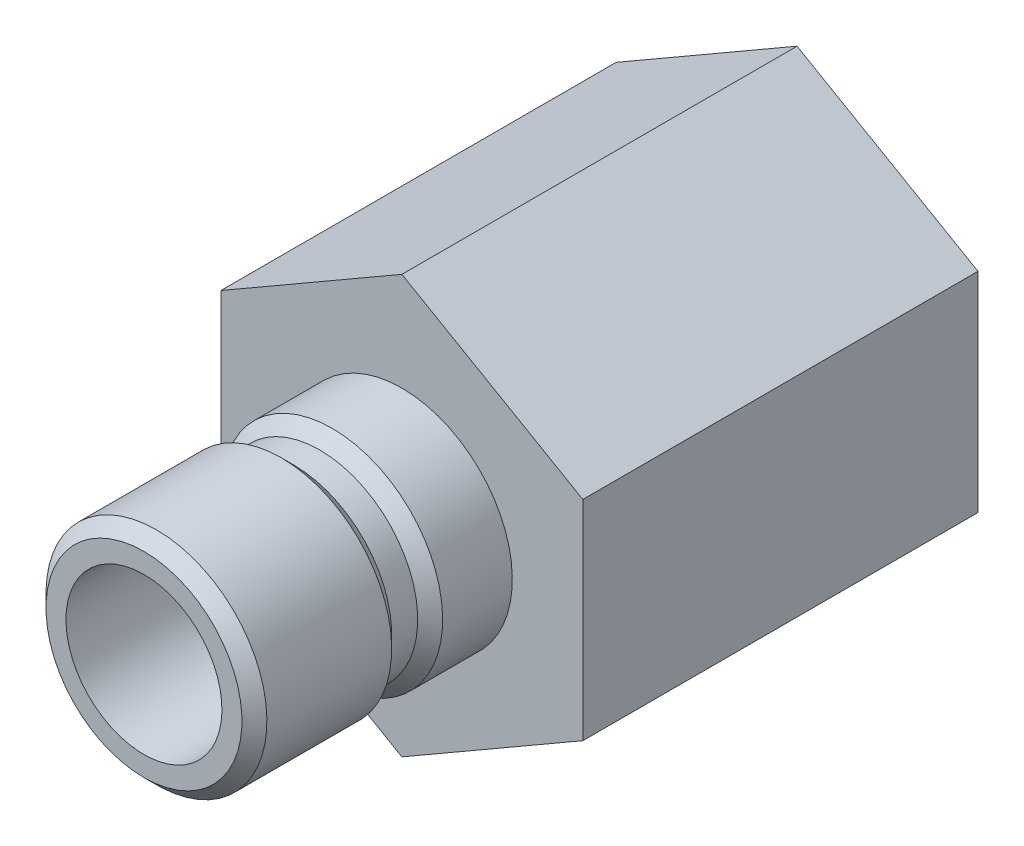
ISO-10303-21;
HEADER;
FILE_DESCRIPTION(('STEP AP214'),'2;1');
FILE_NAME('part.step','',(''),(''),'','','');
FILE_SCHEMA(('AUTOMOTIVE_DESIGN { 1 0 10303 214 1 1 1 1 }'));
ENDSEC;
DATA;
#1=APPLICATION_CONTEXT('core data for automotive mechanical design processes');
#2=APPLICATION_PROTOCOL_DEFINITION('international standard','automotive_design',2000,#1);
#3=PRODUCT_CONTEXT('',#1,'mechanical');
#4=PRODUCT('Part','Part','',(#3));
#5=PRODUCT_RELATED_PRODUCT_CATEGORY('part','',(#4));
#6=PRODUCT_DEFINITION_FORMATION('','',#4);
#7=PRODUCT_DEFINITION_CONTEXT('part definition',#1,'design');
#8=PRODUCT_DEFINITION('design','',#6,#7);
#9=PRODUCT_DEFINITION_SHAPE('','',#8);
#10=(LENGTH_UNIT() NAMED_UNIT(*) SI_UNIT(.MILLI.,.METRE.));
#11=(NAMED_UNIT(*) PLANE_ANGLE_UNIT() SI_UNIT($,.RADIAN.));
#12=(NAMED_UNIT(*) SI_UNIT($,.STERADIAN.) SOLID_ANGLE_UNIT());
#13=UNCERTAINTY_MEASURE_WITH_UNIT(LENGTH_MEASURE(1.E-05),#10,'distance_accuracy_value','');
#14=(GEOMETRIC_REPRESENTATION_CONTEXT(3) GLOBAL_UNCERTAINTY_ASSIGNED_CONTEXT((#13)) GLOBAL_UNIT_ASSIGNED_CONTEXT((#10,
#11,#12)) REPRESENTATION_CONTEXT('',''));
#15=CARTESIAN_POINT('',(0.,0.,0.));
#16=DIRECTION('',(0.,0.,1.));
#17=DIRECTION('',(1.,0.,0.));
#18=AXIS2_PLACEMENT_3D('',#15,#16,#17);
#19=CARTESIAN_POINT('',(0.,13.2842,-24.13));
#20=DIRECTION('',(0.,0.,-1.));
#21=DIRECTION('',(0.,1.,0.));
#22=AXIS2_PLACEMENT_3D('',#19,#20,#21);
#23=PLANE('',#22);
#24=CARTESIAN_POINT('',(0.,0.,-24.13));
#25=DIRECTION('',(0.,0.,-1.));
#26=DIRECTION('',(0.,1.,0.));
#27=AXIS2_PLACEMENT_3D('',#24,#25,#26);
#28=CIRCLE('',#27,9.40156906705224);
#29=CARTESIAN_POINT('',(0.,9.40156906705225,-24.13));
#30=VERTEX_POINT('',#29);
#31=EDGE_CURVE('E162',#30,#30,#28,.T.);
#32=ORIENTED_EDGE('',*,*,#31,.F.);
#33=EDGE_LOOP('',(#32));
#34=FACE_BOUND('',#33,.T.);
#35=DIRECTION('',(0.,-1.,0.));
#36=VECTOR('',#35,1.);
#37=CARTESIAN_POINT('',(-11.049,6.37914312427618,-24.13));
#38=LINE('',#37,#36);
#39=CARTESIAN_POINT('',(-11.049,6.37914312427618,-24.13));
#40=VERTEX_POINT('',#39);
#41=CARTESIAN_POINT('',(-11.049,-6.37914312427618,-24.13));
#42=VERTEX_POINT('',#41);
#43=EDGE_CURVE('E104',#40,#42,#38,.T.);
#44=ORIENTED_EDGE('',*,*,#43,.F.);
#45=DIRECTION('',(-0.866025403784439,-0.5,0.));
#46=VECTOR('',#45,1.);
#47=CARTESIAN_POINT('',(0.,12.7582862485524,-24.13));
#48=LINE('',#47,#46);
#49=CARTESIAN_POINT('',(0.,12.7582862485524,-24.13));
#50=VERTEX_POINT('',#49);
#51=EDGE_CURVE('E49',#50,#40,#48,.T.);
#52=ORIENTED_EDGE('',*,*,#51,.F.);
#53=DIRECTION('',(-0.866025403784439,0.5,0.));
#54=VECTOR('',#53,1.);
#55=CARTESIAN_POINT('',(11.049,6.37914312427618,-24.13));
#56=LINE('',#55,#54);
#57=CARTESIAN_POINT('',(11.049,6.37914312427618,-24.13));
#58=VERTEX_POINT('',#57);
#59=EDGE_CURVE('E110',#58,#50,#56,.T.);
#60=ORIENTED_EDGE('',*,*,#59,.F.);
#61=DIRECTION('',(0.,1.,0.));
#62=VECTOR('',#61,1.);
#63=CARTESIAN_POINT('',(11.049,-6.37914312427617,-24.13));
#64=LINE('',#63,#62);
#65=CARTESIAN_POINT('',(11.049,-6.37914312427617,-24.13));
#66=VERTEX_POINT('',#65);
#67=EDGE_CURVE('E108',#66,#58,#64,.T.);
#68=ORIENTED_EDGE('',*,*,#67,.F.);
#69=DIRECTION('',(0.866025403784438,0.5,0.));
#70=VECTOR('',#69,1.);
#71=CARTESIAN_POINT('',(0.,-12.7582862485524,-24.13));
#72=LINE('',#71,#70);
#73=CARTESIAN_POINT('',(0.,-12.7582862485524,-24.13));
#74=VERTEX_POINT('',#73);
#75=EDGE_CURVE('E91',#74,#66,#72,.T.);
#76=ORIENTED_EDGE('',*,*,#75,.F.);
#77=DIRECTION('',(0.866025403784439,-0.5,0.));
#78=VECTOR('',#77,1.);
#79=CARTESIAN_POINT('',(-11.049,-6.37914312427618,-24.13));
#80=LINE('',#79,#78);
#81=EDGE_CURVE('E99',#42,#74,#80,.T.);
#82=ORIENTED_EDGE('',*,*,#81,.F.);
#83=EDGE_LOOP('',(#44,#52,#60,#68,#76,#82));
#84=FACE_BOUND('',#83,.T.);
#85=ADVANCED_FACE('F34',(#34,#84),#23,.T.);
#86=CARTESIAN_POINT('',(0.,6.7437,0.));
#87=DIRECTION('',(0.,0.,1.));
#88=DIRECTION('',(0.,-1.,0.));
#89=AXIS2_PLACEMENT_3D('',#86,#87,#88);
#90=PLANE('',#89);
#91=CARTESIAN_POINT('',(0.,0.,0.));
#92=DIRECTION('',(0.,0.,-1.));
#93=DIRECTION('',(0.,1.,0.));
#94=AXIS2_PLACEMENT_3D('',#91,#92,#93);
#95=CIRCLE('',#94,6.7437);
#96=CARTESIAN_POINT('',(0.,6.7437,0.));
#97=VERTEX_POINT('',#96);
#98=EDGE_CURVE('E159',#97,#97,#95,.T.);
#99=ORIENTED_EDGE('',*,*,#98,.T.);
#100=EDGE_LOOP('',(#99));
#101=FACE_BOUND('',#100,.T.);
#102=DIRECTION('',(-0.866025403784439,0.5,0.));
#103=VECTOR('',#102,1.);
#104=CARTESIAN_POINT('',(11.049,6.37914312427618,0.));
#105=LINE('',#104,#103);
#106=CARTESIAN_POINT('',(11.049,6.37914312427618,0.));
#107=VERTEX_POINT('',#106);
#108=CARTESIAN_POINT('',(0.,12.7582862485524,0.));
#109=VERTEX_POINT('',#108);
#110=EDGE_CURVE('E128',#107,#109,#105,.T.);
#111=ORIENTED_EDGE('',*,*,#110,.T.);
#112=DIRECTION('',(-0.866025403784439,-0.5,0.));
#113=VECTOR('',#112,1.);
#114=CARTESIAN_POINT('',(0.,12.7582862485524,0.));
#115=LINE('',#114,#113);
#116=CARTESIAN_POINT('',(-11.049,6.37914312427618,0.));
#117=VERTEX_POINT('',#116);
#118=EDGE_CURVE('E117',#109,#117,#115,.T.);
#119=ORIENTED_EDGE('',*,*,#118,.T.);
#120=DIRECTION('',(0.,-1.,0.));
#121=VECTOR('',#120,1.);
#122=CARTESIAN_POINT('',(-11.049,6.37914312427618,0.));
#123=LINE('',#122,#121);
#124=CARTESIAN_POINT('',(-11.049,-6.37914312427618,0.));
#125=VERTEX_POINT('',#124);
#126=EDGE_CURVE('E120',#117,#125,#123,.T.);
#127=ORIENTED_EDGE('',*,*,#126,.T.);
#128=DIRECTION('',(0.866025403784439,-0.5,0.));
#129=VECTOR('',#128,1.);
#130=CARTESIAN_POINT('',(-11.049,-6.37914312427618,0.));
#131=LINE('',#130,#129);
#132=CARTESIAN_POINT('',(0.,-12.7582862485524,0.));
#133=VERTEX_POINT('',#132);
#134=EDGE_CURVE('E57',#125,#133,#131,.T.);
#135=ORIENTED_EDGE('',*,*,#134,.T.);
#136=DIRECTION('',(0.866025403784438,0.5,0.));
#137=VECTOR('',#136,1.);
#138=CARTESIAN_POINT('',(0.,-12.7582862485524,0.));
#139=LINE('',#138,#137);
#140=CARTESIAN_POINT('',(11.049,-6.37914312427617,0.));
#141=VERTEX_POINT('',#140);
#142=EDGE_CURVE('E94',#133,#141,#139,.T.);
#143=ORIENTED_EDGE('',*,*,#142,.T.);
#144=DIRECTION('',(0.,1.,0.));
#145=VECTOR('',#144,1.);
#146=CARTESIAN_POINT('',(11.049,-6.37914312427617,0.));
#147=LINE('',#146,#145);
#148=EDGE_CURVE('E125',#141,#107,#147,.T.);
#149=ORIENTED_EDGE('',*,*,#148,.T.);
#150=EDGE_LOOP('',(#111,#119,#127,#135,#143,#149));
#151=FACE_BOUND('',#150,.T.);
#152=ADVANCED_FACE('F184',(#101,#151),#90,.T.);
#153=CARTESIAN_POINT('',(0.,0.,0.));
#154=DIRECTION('',(0.,0.,-1.));
#155=DIRECTION('',(0.,1.,0.));
#156=AXIS2_PLACEMENT_3D('',#153,#154,#155);
#157=CYLINDRICAL_SURFACE('',#156,4.7625);
#158=CARTESIAN_POINT('',(0.,0.,-8.97890000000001));
#159=DIRECTION('',(0.,0.,-1.));
#160=DIRECTION('',(0.,1.,0.));
#161=AXIS2_PLACEMENT_3D('',#158,#159,#160);
#162=CIRCLE('',#161,4.7625);
#163=CARTESIAN_POINT('',(0.,4.7625,-8.97890000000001));
#164=VERTEX_POINT('',#163);
#165=EDGE_CURVE('E12',#164,#164,#162,.T.);
#166=ORIENTED_EDGE('',*,*,#165,.T.);
#167=EDGE_LOOP('',(#166));
#168=FACE_BOUND('',#167,.T.);
#169=CARTESIAN_POINT('',(0.,0.,15.748));
#170=DIRECTION('',(0.,0.,-1.));
#171=DIRECTION('',(0.,1.,0.));
#172=AXIS2_PLACEMENT_3D('',#169,#170,#171);
#173=CIRCLE('',#172,4.7625);
#174=CARTESIAN_POINT('',(0.,4.7625,15.748));
#175=VERTEX_POINT('',#174);
#176=EDGE_CURVE('E133',#175,#175,#173,.T.);
#177=ORIENTED_EDGE('',*,*,#176,.F.);
#178=EDGE_LOOP('',(#177));
#179=FACE_BOUND('',#178,.T.);
#180=ADVANCED_FACE('F36',(#168,#179),#157,.F.);
#181=CARTESIAN_POINT('',(0.,4.7625,-8.97890000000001));
#182=DIRECTION('',(0.,0.,-1.));
#183=DIRECTION('',(0.,1.,0.));
#184=AXIS2_PLACEMENT_3D('',#181,#182,#183);
#185=PLANE('',#184);
#186=CARTESIAN_POINT('',(0.,0.,-8.97890000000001));
#187=DIRECTION('',(0.,0.,-1.));
#188=DIRECTION('',(0.,1.,0.));
#189=AXIS2_PLACEMENT_3D('',#186,#187,#188);
#190=CIRCLE('',#189,8.9281);
#191=CARTESIAN_POINT('',(0.,8.9281,-8.97890000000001));
#192=VERTEX_POINT('',#191);
#193=EDGE_CURVE('E42',#192,#192,#190,.T.);
#194=ORIENTED_EDGE('',*,*,#193,.T.);
#195=EDGE_LOOP('',(#194));
#196=FACE_BOUND('',#195,.T.);
#197=ORIENTED_EDGE('',*,*,#165,.F.);
#198=EDGE_LOOP('',(#197));
#199=FACE_BOUND('',#198,.T.);
#200=ADVANCED_FACE('F167',(#196,#199),#185,.T.);
#201=CARTESIAN_POINT('',(0.,0.,-8.97890000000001));
#202=DIRECTION('',(0.,0.,-1.));
#203=DIRECTION('',(0.,1.,0.));
#204=AXIS2_PLACEMENT_3D('',#201,#202,#203);
#205=CONICAL_SURFACE('',#204,8.9281,0.0312396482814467);
#206=ORIENTED_EDGE('',*,*,#31,.T.);
#207=EDGE_LOOP('',(#206));
#208=FACE_BOUND('',#207,.T.);
#209=ORIENTED_EDGE('',*,*,#193,.F.);
#210=EDGE_LOOP('',(#209));
#211=FACE_BOUND('',#210,.T.);
#212=ADVANCED_FACE('F170',(#208,#211),#205,.F.);
#213=CARTESIAN_POINT('',(0.,0.,0.));
#214=DIRECTION('',(0.,0.,-1.));
#215=DIRECTION('',(0.,1.,0.));
#216=AXIS2_PLACEMENT_3D('',#213,#214,#215);
#217=CYLINDRICAL_SURFACE('',#216,6.7437);
#218=CARTESIAN_POINT('',(0.,0.,4.25449999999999));
#219=DIRECTION('',(0.,0.,-1.));
#220=DIRECTION('',(0.,1.,0.));
#221=AXIS2_PLACEMENT_3D('',#218,#219,#220);
#222=CIRCLE('',#221,6.7437);
#223=CARTESIAN_POINT('',(0.,6.7437,4.25449999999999));
#224=VERTEX_POINT('',#223);
#225=EDGE_CURVE('E156',#224,#224,#222,.T.);
#226=ORIENTED_EDGE('',*,*,#225,.T.);
#227=EDGE_LOOP('',(#226));
#228=FACE_BOUND('',#227,.T.);
#229=ORIENTED_EDGE('',*,*,#98,.F.);
#230=EDGE_LOOP('',(#229));
#231=FACE_BOUND('',#230,.T.);
#232=ADVANCED_FACE('F172',(#228,#231),#217,.T.);
#233=CARTESIAN_POINT('',(0.,0.,4.25449999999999));
#234=DIRECTION('',(0.,0.,-1.));
#235=DIRECTION('',(0.,1.,0.));
#236=AXIS2_PLACEMENT_3D('',#233,#234,#235);
#237=CONICAL_SURFACE('',#236,6.7437,0.785398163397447);
#238=CARTESIAN_POINT('',(0.,0.,5.0165));
#239=DIRECTION('',(0.,0.,-1.));
#240=DIRECTION('',(0.,1.,0.));
#241=AXIS2_PLACEMENT_3D('',#238,#239,#240);
#242=CIRCLE('',#241,5.9817);
#243=CARTESIAN_POINT('',(0.,5.9817,5.0165));
#244=VERTEX_POINT('',#243);
#245=EDGE_CURVE('E153',#244,#244,#242,.T.);
#246=ORIENTED_EDGE('',*,*,#245,.T.);
#247=EDGE_LOOP('',(#246));
#248=FACE_BOUND('',#247,.T.);
#249=ORIENTED_EDGE('',*,*,#225,.F.);
#250=EDGE_LOOP('',(#249));
#251=FACE_BOUND('',#250,.T.);
#252=ADVANCED_FACE('F179',(#248,#251),#237,.T.);
#253=CARTESIAN_POINT('',(0.,0.,0.));
#254=DIRECTION('',(0.,0.,-1.));
#255=DIRECTION('',(0.,1.,0.));
#256=AXIS2_PLACEMENT_3D('',#253,#254,#255);
#257=CYLINDRICAL_SURFACE('',#256,5.9817);
#258=CARTESIAN_POINT('',(0.,0.,6.604));
#259=DIRECTION('',(0.,0.,-1.));
#260=DIRECTION('',(0.,1.,0.));
#261=AXIS2_PLACEMENT_3D('',#258,#259,#260);
#262=CIRCLE('',#261,5.9817);
#263=CARTESIAN_POINT('',(0.,5.9817,6.604));
#264=VERTEX_POINT('',#263);
#265=EDGE_CURVE('E150',#264,#264,#262,.T.);
#266=ORIENTED_EDGE('',*,*,#265,.T.);
#267=EDGE_LOOP('',(#266));
#268=FACE_BOUND('',#267,.T.);
#269=ORIENTED_EDGE('',*,*,#245,.F.);
#270=EDGE_LOOP('',(#269));
#271=FACE_BOUND('',#270,.T.);
#272=ADVANCED_FACE('F195',(#268,#271),#257,.T.);
#273=CARTESIAN_POINT('',(0.,0.,6.604));
#274=DIRECTION('',(0.,0.,1.));
#275=DIRECTION('',(0.,-1.,0.));
#276=AXIS2_PLACEMENT_3D('',#273,#274,#275);
#277=CONICAL_SURFACE('',#276,5.9817,0.785398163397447);
#278=CARTESIAN_POINT('',(0.,0.,7.366));
#279=DIRECTION('',(0.,0.,-1.));
#280=DIRECTION('',(0.,1.,0.));
#281=AXIS2_PLACEMENT_3D('',#278,#279,#280);
#282=CIRCLE('',#281,6.7437);
#283=CARTESIAN_POINT('',(0.,6.7437,7.366));
#284=VERTEX_POINT('',#283);
#285=EDGE_CURVE('E147',#284,#284,#282,.T.);
#286=ORIENTED_EDGE('',*,*,#285,.T.);
#287=EDGE_LOOP('',(#286));
#288=FACE_BOUND('',#287,.T.);
#289=ORIENTED_EDGE('',*,*,#265,.F.);
#290=EDGE_LOOP('',(#289));
#291=FACE_BOUND('',#290,.T.);
#292=ADVANCED_FACE('F199',(#288,#291),#277,.T.);
#293=CARTESIAN_POINT('',(0.,0.,0.));
#294=DIRECTION('',(0.,0.,-1.));
#295=DIRECTION('',(0.,1.,0.));
#296=AXIS2_PLACEMENT_3D('',#293,#294,#295);
#297=CYLINDRICAL_SURFACE('',#296,6.7437);
#298=CARTESIAN_POINT('',(0.,0.,14.986));
#299=DIRECTION('',(0.,0.,-1.));
#300=DIRECTION('',(0.,1.,0.));
#301=AXIS2_PLACEMENT_3D('',#298,#299,#300);
#302=CIRCLE('',#301,6.7437);
#303=CARTESIAN_POINT('',(0.,6.7437,14.986));
#304=VERTEX_POINT('',#303);
#305=EDGE_CURVE('E144',#304,#304,#302,.T.);
#306=ORIENTED_EDGE('',*,*,#305,.T.);
#307=EDGE_LOOP('',(#306));
#308=FACE_BOUND('',#307,.T.);
#309=ORIENTED_EDGE('',*,*,#285,.F.);
#310=EDGE_LOOP('',(#309));
#311=FACE_BOUND('',#310,.T.);
#312=ADVANCED_FACE('F203',(#308,#311),#297,.T.);
#313=CARTESIAN_POINT('',(0.,0.,14.986));
#314=DIRECTION('',(0.,0.,-1.));
#315=DIRECTION('',(0.,1.,0.));
#316=AXIS2_PLACEMENT_3D('',#313,#314,#315);
#317=CONICAL_SURFACE('',#316,6.7437,0.785398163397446);
#318=CARTESIAN_POINT('',(0.,0.,15.748));
#319=DIRECTION('',(0.,0.,-1.));
#320=DIRECTION('',(0.,1.,0.));
#321=AXIS2_PLACEMENT_3D('',#318,#319,#320);
#322=CIRCLE('',#321,5.9817);
#323=CARTESIAN_POINT('',(0.,5.9817,15.748));
#324=VERTEX_POINT('',#323);
#325=EDGE_CURVE('E141',#324,#324,#322,.T.);
#326=ORIENTED_EDGE('',*,*,#325,.T.);
#327=EDGE_LOOP('',(#326));
#328=FACE_BOUND('',#327,.T.);
#329=ORIENTED_EDGE('',*,*,#305,.F.);
#330=EDGE_LOOP('',(#329));
#331=FACE_BOUND('',#330,.T.);
#332=ADVANCED_FACE('F207',(#328,#331),#317,.T.);
#333=CARTESIAN_POINT('',(0.,4.7625,15.748));
#334=DIRECTION('',(0.,0.,1.));
#335=DIRECTION('',(0.,-1.,0.));
#336=AXIS2_PLACEMENT_3D('',#333,#334,#335);
#337=PLANE('',#336);
#338=ORIENTED_EDGE('',*,*,#176,.T.);
#339=EDGE_LOOP('',(#338));
#340=FACE_BOUND('',#339,.T.);
#341=ORIENTED_EDGE('',*,*,#325,.F.);
#342=EDGE_LOOP('',(#341));
#343=FACE_BOUND('',#342,.T.);
#344=ADVANCED_FACE('F211',(#340,#343),#337,.T.);
#345=CARTESIAN_POINT('',(0.,12.7582862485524,-24.13));
#346=DIRECTION('',(-0.5,0.866025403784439,0.));
#347=DIRECTION('',(-0.866025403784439,-0.5,0.));
#348=AXIS2_PLACEMENT_3D('',#345,#346,#347);
#349=PLANE('',#348);
#350=ORIENTED_EDGE('',*,*,#118,.F.);
#351=DIRECTION('',(0.,0.,1.));
#352=VECTOR('',#351,1.);
#353=CARTESIAN_POINT('',(0.,12.7582862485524,-24.13));
#354=LINE('',#353,#352);
#355=EDGE_CURVE('E131',#50,#109,#354,.T.);
#356=ORIENTED_EDGE('',*,*,#355,.F.);
#357=ORIENTED_EDGE('',*,*,#51,.T.);
#358=DIRECTION('',(0.,0.,1.));
#359=VECTOR('',#358,1.);
#360=CARTESIAN_POINT('',(-11.049,6.37914312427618,-24.13));
#361=LINE('',#360,#359);
#362=EDGE_CURVE('E116',#40,#117,#361,.T.);
#363=ORIENTED_EDGE('',*,*,#362,.T.);
#364=EDGE_LOOP('',(#350,#356,#357,#363));
#365=FACE_BOUND('',#364,.T.);
#366=ADVANCED_FACE('F215',(#365),#349,.T.);
#367=CARTESIAN_POINT('',(11.049,6.37914312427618,-24.13));
#368=DIRECTION('',(0.5,0.866025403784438,0.));
#369=DIRECTION('',(-0.866025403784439,0.5,0.));
#370=AXIS2_PLACEMENT_3D('',#367,#368,#369);
#371=PLANE('',#370);
#372=ORIENTED_EDGE('',*,*,#110,.F.);
#373=DIRECTION('',(0.,0.,1.));
#374=VECTOR('',#373,1.);
#375=CARTESIAN_POINT('',(11.049,6.37914312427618,-24.13));
#376=LINE('',#375,#374);
#377=EDGE_CURVE('E134',#58,#107,#376,.T.);
#378=ORIENTED_EDGE('',*,*,#377,.F.);
#379=ORIENTED_EDGE('',*,*,#59,.T.);
#380=ORIENTED_EDGE('',*,*,#355,.T.);
#381=EDGE_LOOP('',(#372,#378,#379,#380));
#382=FACE_BOUND('',#381,.T.);
#383=ADVANCED_FACE('F219',(#382),#371,.T.);
#384=CARTESIAN_POINT('',(11.049,-6.37914312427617,-24.13));
#385=DIRECTION('',(1.,0.,0.));
#386=DIRECTION('',(0.,0.,-1.));
#387=AXIS2_PLACEMENT_3D('',#384,#385,#386);
#388=PLANE('',#387);
#389=ORIENTED_EDGE('',*,*,#148,.F.);
#390=DIRECTION('',(0.,0.,1.));
#391=VECTOR('',#390,1.);
#392=CARTESIAN_POINT('',(11.049,-6.37914312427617,-24.13));
#393=LINE('',#392,#391);
#394=EDGE_CURVE('E95',#66,#141,#393,.T.);
#395=ORIENTED_EDGE('',*,*,#394,.F.);
#396=ORIENTED_EDGE('',*,*,#67,.T.);
#397=ORIENTED_EDGE('',*,*,#377,.T.);
#398=EDGE_LOOP('',(#389,#395,#396,#397));
#399=FACE_BOUND('',#398,.T.);
#400=ADVANCED_FACE('F228',(#399),#388,.T.);
#401=CARTESIAN_POINT('',(0.,-12.7582862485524,-24.13));
#402=DIRECTION('',(0.5,-0.866025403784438,0.));
#403=DIRECTION('',(0.866025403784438,0.5,0.));
#404=AXIS2_PLACEMENT_3D('',#401,#402,#403);
#405=PLANE('',#404);
#406=ORIENTED_EDGE('',*,*,#142,.F.);
#407=DIRECTION('',(0.,0.,1.));
#408=VECTOR('',#407,1.);
#409=CARTESIAN_POINT('',(0.,-12.7582862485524,-24.13));
#410=LINE('',#409,#408);
#411=EDGE_CURVE('E87',#74,#133,#410,.T.);
#412=ORIENTED_EDGE('',*,*,#411,.F.);
#413=ORIENTED_EDGE('',*,*,#75,.T.);
#414=ORIENTED_EDGE('',*,*,#394,.T.);
#415=EDGE_LOOP('',(#406,#412,#413,#414));
#416=FACE_BOUND('',#415,.T.);
#417=ADVANCED_FACE('F89',(#416),#405,.T.);
#418=CARTESIAN_POINT('',(-11.049,-6.37914312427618,-24.13));
#419=DIRECTION('',(-0.5,-0.866025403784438,0.));
#420=DIRECTION('',(0.866025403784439,-0.5,0.));
#421=AXIS2_PLACEMENT_3D('',#418,#419,#420);
#422=PLANE('',#421);
#423=ORIENTED_EDGE('',*,*,#134,.F.);
#424=DIRECTION('',(0.,0.,1.));
#425=VECTOR('',#424,1.);
#426=CARTESIAN_POINT('',(-11.049,-6.37914312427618,-24.13));
#427=LINE('',#426,#425);
#428=EDGE_CURVE('E96',#42,#125,#427,.T.);
#429=ORIENTED_EDGE('',*,*,#428,.F.);
#430=ORIENTED_EDGE('',*,*,#81,.T.);
#431=ORIENTED_EDGE('',*,*,#411,.T.);
#432=EDGE_LOOP('',(#423,#429,#430,#431));
#433=FACE_BOUND('',#432,.T.);
#434=ADVANCED_FACE('F100',(#433),#422,.T.);
#435=CARTESIAN_POINT('',(-11.049,6.37914312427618,-24.13));
#436=DIRECTION('',(-1.,0.,0.));
#437=DIRECTION('',(0.,-1.,0.));
#438=AXIS2_PLACEMENT_3D('',#435,#436,#437);
#439=PLANE('',#438);
#440=ORIENTED_EDGE('',*,*,#126,.F.);
#441=ORIENTED_EDGE('',*,*,#362,.F.);
#442=ORIENTED_EDGE('',*,*,#43,.T.);
#443=ORIENTED_EDGE('',*,*,#428,.T.);
#444=EDGE_LOOP('',(#440,#441,#442,#443));
#445=FACE_BOUND('',#444,.T.);
#446=ADVANCED_FACE('F220',(#445),#439,.T.);
#447=CLOSED_SHELL('',(#85,#152,#180,#200,#212,#232,#252,#272,#292,#312,#332,#344,#366,#383,#400,
#417,#434,#446));
#448=MANIFOLD_SOLID_BREP('B2',#447);
#449=ADVANCED_BREP_SHAPE_REPRESENTATION('',(#18,#448),#14);
#450=SHAPE_DEFINITION_REPRESENTATION(#9,#449);
ENDSEC;
END-ISO-10303-21;
